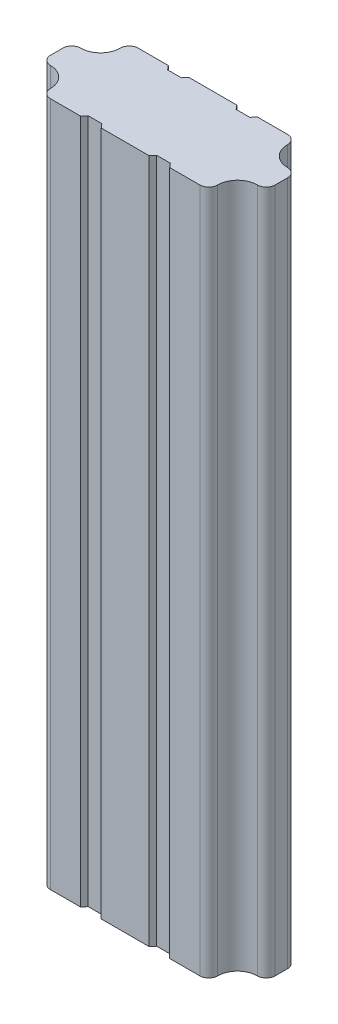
from build123d import *

# Parameters (mm, degrees)
SALIENTE_EXTRUIR1_DEPTH = 500


with BuildPart() as part:
    # Croquis2 → Saliente-Extruir1 (new body)
    with BuildSketch(Plane(origin=(0, 0, 0), x_dir=(1, 0, 0), z_dir=(0, 1, 0))):
        with BuildLine():
            ThreePointArc((-61, 25.5), (-59.096194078, 30.096194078), (-54.5, 32))
            Line((-54.5, 32), (-32.517298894, 32))
            Line((-32.517298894, 32), (-30, 29))
            Line((-30, 29), (-20, 29))
            Line((-20, 29), (-17.482701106, 32))
            Line((-17.482701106, 32), (17.482701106, 32))
            Line((17.482701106, 32), (20, 29))
            Line((20, 29), (30, 29))
            Line((30, 29), (32.517298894, 32))
            Line((32.517298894, 32), (54.5, 32))
            ThreePointArc((54.5, 32), (59.096194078, 30.096194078), (61, 25.5))
            ThreePointArc((61, 25.5), (65.246951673, 15.246951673), (75.5, 11))
            ThreePointArc((75.5, 11), (80.096194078, 9.096194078), (82, 4.5))
            Line((82, 4.5), (82, -4.5))
            ThreePointArc((82, -4.5), (80.096194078, -9.096194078), (75.5, -11))
            ThreePointArc((75.5, -11), (65.246951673, -15.246951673), (61, -25.5))
            ThreePointArc((61, -25.5), (59.096194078, -30.096194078), (54.5, -32))
            Line((54.5, -32), (32.517298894, -32))
            Line((32.517298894, -32), (30, -29))
            Line((30, -29), (20, -29))
            Line((20, -29), (17.482701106, -32))
            Line((17.482701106, -32), (-17.482701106, -32))
            Line((-17.482701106, -32), (-20, -29))
            Line((-20, -29), (-30, -29))
            Line((-30, -29), (-32.517298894, -32))
            Line((-32.517298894, -32), (-54.5, -32))
            ThreePointArc((-54.5, -32), (-59.096194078, -30.096194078), (-61, -25.5))
            ThreePointArc((-61, -25.5), (-65.246951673, -15.246951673), (-75.5, -11))
            ThreePointArc((-75.5, -11), (-80.096194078, -9.096194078), (-82, -4.5))
            Line((-82, -4.5), (-82, 4.5))
            ThreePointArc((-82, 4.5), (-80.096194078, 9.096194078), (-75.5, 11))
            ThreePointArc((-75.5, 11), (-65.246951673, 15.246951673), (-61, 25.5))
        make_face()
    extrude(amount=SALIENTE_EXTRUIR1_DEPTH)


solid = part.part
